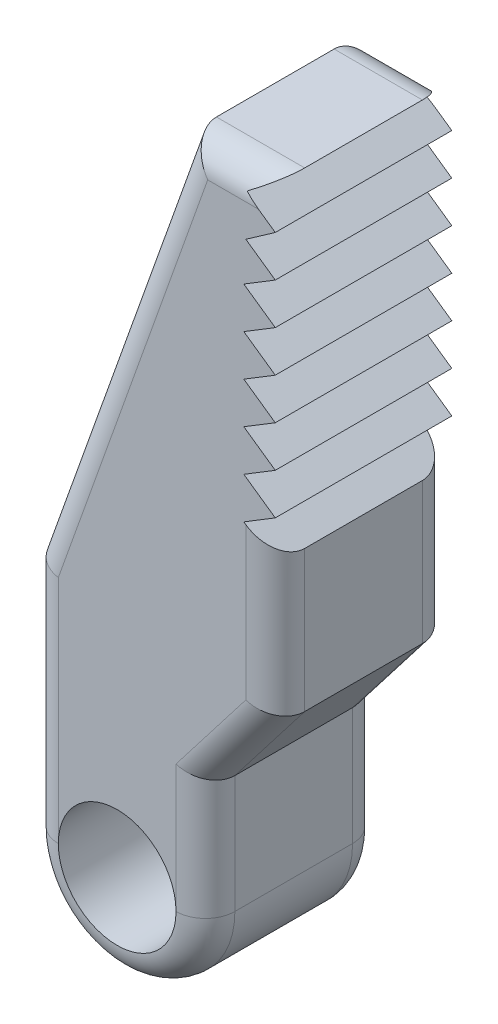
ISO-10303-21;
HEADER;
FILE_DESCRIPTION(('STEP AP214'),'2;1');
FILE_NAME('part.step','',(''),(''),'','','');
FILE_SCHEMA(('AUTOMOTIVE_DESIGN { 1 0 10303 214 1 1 1 1 }'));
ENDSEC;
DATA;
#1=APPLICATION_CONTEXT('core data for automotive mechanical design processes');
#2=APPLICATION_PROTOCOL_DEFINITION('international standard','automotive_design',2000,#1);
#3=PRODUCT_CONTEXT('',#1,'mechanical');
#4=PRODUCT('Part','Part','',(#3));
#5=PRODUCT_RELATED_PRODUCT_CATEGORY('part','',(#4));
#6=PRODUCT_DEFINITION_FORMATION('','',#4);
#7=PRODUCT_DEFINITION_CONTEXT('part definition',#1,'design');
#8=PRODUCT_DEFINITION('design','',#6,#7);
#9=PRODUCT_DEFINITION_SHAPE('','',#8);
#10=(LENGTH_UNIT() NAMED_UNIT(*) SI_UNIT(.MILLI.,.METRE.));
#11=(NAMED_UNIT(*) PLANE_ANGLE_UNIT() SI_UNIT($,.RADIAN.));
#12=(NAMED_UNIT(*) SI_UNIT($,.STERADIAN.) SOLID_ANGLE_UNIT());
#13=UNCERTAINTY_MEASURE_WITH_UNIT(LENGTH_MEASURE(1.E-05),#10,'distance_accuracy_value','');
#14=(GEOMETRIC_REPRESENTATION_CONTEXT(3) GLOBAL_UNCERTAINTY_ASSIGNED_CONTEXT((#13)) GLOBAL_UNIT_ASSIGNED_CONTEXT((#10,
#11,#12)) REPRESENTATION_CONTEXT('',''));
#15=CARTESIAN_POINT('',(0.,0.,0.));
#16=DIRECTION('',(0.,0.,1.));
#17=DIRECTION('',(1.,0.,0.));
#18=AXIS2_PLACEMENT_3D('',#15,#16,#17);
#19=CARTESIAN_POINT('',(0.,0.,30.));
#20=DIRECTION('',(0.,0.,1.));
#21=DIRECTION('',(1.,0.,0.));
#22=AXIS2_PLACEMENT_3D('',#19,#20,#21);
#23=PLANE('',#22);
#24=DIRECTION('',(0.61141501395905,0.791310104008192,0.));
#25=VECTOR('',#24,1.);
#26=CARTESIAN_POINT('',(22.9074192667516,38.4117506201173,30.));
#27=LINE('',#26,#25);
#28=CARTESIAN_POINT('',(10.,21.7066140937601,30.));
#29=VERTEX_POINT('',#28);
#30=CARTESIAN_POINT('',(21.8639697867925,37.0612896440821,30.));
#31=VERTEX_POINT('',#30);
#32=EDGE_CURVE('E411',#29,#31,#27,.T.);
#33=ORIENTED_EDGE('',*,*,#32,.T.);
#34=DIRECTION('',(0.,1.,0.));
#35=VECTOR('',#34,1.);
#36=CARTESIAN_POINT('',(21.8639697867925,59.354675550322,30.));
#37=LINE('',#36,#35);
#38=CARTESIAN_POINT('',(21.8639697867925,62.854675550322,30.));
#39=VERTEX_POINT('',#38);
#40=EDGE_CURVE('E244',#31,#39,#37,.T.);
#41=ORIENTED_EDGE('',*,*,#40,.T.);
#42=DIRECTION('',(-0.819231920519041,0.573462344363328,0.));
#43=VECTOR('',#42,1.);
#44=CARTESIAN_POINT('',(21.5211331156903,63.0946612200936,30.));
#45=LINE('',#44,#43);
#46=CARTESIAN_POINT('',(21.5211331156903,63.0946612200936,30.));
#47=VERTEX_POINT('',#46);
#48=EDGE_CURVE('E238',#39,#47,#45,.T.);
#49=ORIENTED_EDGE('',*,*,#48,.T.);
#50=DIRECTION('',(0.853640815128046,0.520862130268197,0.));
#51=VECTOR('',#50,1.);
#52=CARTESIAN_POINT('',(26.8639697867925,66.354675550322,30.));
#53=LINE('',#52,#51);
#54=CARTESIAN_POINT('',(26.8639697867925,66.354675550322,30.));
#55=VERTEX_POINT('',#54);
#56=EDGE_CURVE('E241',#47,#55,#53,.T.);
#57=ORIENTED_EDGE('',*,*,#56,.T.);
#58=DIRECTION('',(-0.819231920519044,0.573462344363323,0.));
#59=VECTOR('',#58,1.);
#60=CARTESIAN_POINT('',(21.5211331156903,70.0946612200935,30.));
#61=LINE('',#60,#59);
#62=CARTESIAN_POINT('',(21.5211331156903,70.0946612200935,30.));
#63=VERTEX_POINT('',#62);
#64=EDGE_CURVE('E262',#55,#63,#61,.T.);
#65=ORIENTED_EDGE('',*,*,#64,.T.);
#66=DIRECTION('',(0.853640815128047,0.520862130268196,0.));
#67=VECTOR('',#66,1.);
#68=CARTESIAN_POINT('',(26.8639697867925,73.354675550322,30.));
#69=LINE('',#68,#67);
#70=CARTESIAN_POINT('',(26.8639697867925,73.354675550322,30.));
#71=VERTEX_POINT('',#70);
#72=EDGE_CURVE('E264',#63,#71,#69,.T.);
#73=ORIENTED_EDGE('',*,*,#72,.T.);
#74=DIRECTION('',(-0.819231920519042,0.573462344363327,0.));
#75=VECTOR('',#74,1.);
#76=CARTESIAN_POINT('',(21.5211331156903,77.0946612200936,30.));
#77=LINE('',#76,#75);
#78=CARTESIAN_POINT('',(21.5211331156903,77.0946612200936,30.));
#79=VERTEX_POINT('',#78);
#80=EDGE_CURVE('E269',#71,#79,#77,.T.);
#81=ORIENTED_EDGE('',*,*,#80,.T.);
#82=DIRECTION('',(0.853640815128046,0.520862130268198,0.));
#83=VECTOR('',#82,1.);
#84=CARTESIAN_POINT('',(26.8639697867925,80.354675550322,30.));
#85=LINE('',#84,#83);
#86=CARTESIAN_POINT('',(26.8639697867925,80.354675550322,30.));
#87=VERTEX_POINT('',#86);
#88=EDGE_CURVE('E271',#79,#87,#85,.T.);
#89=ORIENTED_EDGE('',*,*,#88,.T.);
#90=DIRECTION('',(-0.819231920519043,0.573462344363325,0.));
#91=VECTOR('',#90,1.);
#92=CARTESIAN_POINT('',(21.5211331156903,84.0946612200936,30.));
#93=LINE('',#92,#91);
#94=CARTESIAN_POINT('',(21.5211331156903,84.0946612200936,30.));
#95=VERTEX_POINT('',#94);
#96=EDGE_CURVE('E273',#87,#95,#93,.T.);
#97=ORIENTED_EDGE('',*,*,#96,.T.);
#98=DIRECTION('',(0.853640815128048,0.520862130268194,0.));
#99=VECTOR('',#98,1.);
#100=CARTESIAN_POINT('',(26.8639697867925,87.354675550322,30.));
#101=LINE('',#100,#99);
#102=CARTESIAN_POINT('',(26.8639697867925,87.354675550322,30.));
#103=VERTEX_POINT('',#102);
#104=EDGE_CURVE('E275',#95,#103,#101,.T.);
#105=ORIENTED_EDGE('',*,*,#104,.T.);
#106=DIRECTION('',(-0.819231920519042,0.573462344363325,0.));
#107=VECTOR('',#106,1.);
#108=CARTESIAN_POINT('',(21.5211331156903,91.0946612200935,30.));
#109=LINE('',#108,#107);
#110=CARTESIAN_POINT('',(21.5211331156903,91.0946612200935,30.));
#111=VERTEX_POINT('',#110);
#112=EDGE_CURVE('E277',#103,#111,#109,.T.);
#113=ORIENTED_EDGE('',*,*,#112,.T.);
#114=DIRECTION('',(0.853640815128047,0.520862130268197,0.));
#115=VECTOR('',#114,1.);
#116=CARTESIAN_POINT('',(26.8639697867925,94.354675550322,30.));
#117=LINE('',#116,#115);
#118=CARTESIAN_POINT('',(26.8639697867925,94.354675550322,30.));
#119=VERTEX_POINT('',#118);
#120=EDGE_CURVE('E279',#111,#119,#117,.T.);
#121=ORIENTED_EDGE('',*,*,#120,.T.);
#122=DIRECTION('',(-0.819231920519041,0.573462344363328,0.));
#123=VECTOR('',#122,1.);
#124=CARTESIAN_POINT('',(21.5211331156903,98.0946612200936,30.));
#125=LINE('',#124,#123);
#126=CARTESIAN_POINT('',(21.5211331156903,98.0946612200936,30.));
#127=VERTEX_POINT('',#126);
#128=EDGE_CURVE('E281',#119,#127,#125,.T.);
#129=ORIENTED_EDGE('',*,*,#128,.T.);
#130=DIRECTION('',(0.853640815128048,0.520862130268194,0.));
#131=VECTOR('',#130,1.);
#132=CARTESIAN_POINT('',(26.8639697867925,101.354675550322,30.));
#133=LINE('',#132,#131);
#134=CARTESIAN_POINT('',(26.8639697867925,101.354675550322,30.));
#135=VERTEX_POINT('',#134);
#136=EDGE_CURVE('E283',#127,#135,#133,.T.);
#137=ORIENTED_EDGE('',*,*,#136,.T.);
#138=DIRECTION('',(-0.819231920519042,0.573462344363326,0.));
#139=VECTOR('',#138,1.);
#140=CARTESIAN_POINT('',(21.8639697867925,104.854675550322,30.));
#141=LINE('',#140,#139);
#142=CARTESIAN_POINT('',(21.8639697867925,104.854675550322,30.));
#143=VERTEX_POINT('',#142);
#144=EDGE_CURVE('E285',#135,#143,#141,.T.);
#145=ORIENTED_EDGE('',*,*,#144,.T.);
#146=DIRECTION('',(0.81923192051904,0.573462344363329,0.));
#147=VECTOR('',#146,1.);
#148=CARTESIAN_POINT('',(26.8639697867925,108.354675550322,30.));
#149=LINE('',#148,#147);
#150=CARTESIAN_POINT('',(26.8639697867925,108.354675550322,30.));
#151=VERTEX_POINT('',#150);
#152=EDGE_CURVE('E287',#143,#151,#149,.T.);
#153=ORIENTED_EDGE('',*,*,#152,.T.);
#154=DIRECTION('',(-0.81923192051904,0.573462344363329,0.));
#155=VECTOR('',#154,1.);
#156=CARTESIAN_POINT('',(21.8639697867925,111.854675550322,30.));
#157=LINE('',#156,#155);
#158=CARTESIAN_POINT('',(24.0068269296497,110.354675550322,30.));
#159=VERTEX_POINT('',#158);
#160=EDGE_CURVE('E289',#151,#159,#157,.T.);
#161=ORIENTED_EDGE('',*,*,#160,.T.);
#162=DIRECTION('',(-1.,0.,0.));
#163=VECTOR('',#162,1.);
#164=CARTESIAN_POINT('',(11.8639697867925,110.354675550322,30.));
#165=LINE('',#164,#163);
#166=CARTESIAN_POINT('',(15.3896986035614,110.354675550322,30.));
#167=VERTEX_POINT('',#166);
#168=EDGE_CURVE('E405',#159,#167,#165,.T.);
#169=ORIENTED_EDGE('',*,*,#168,.T.);
#170=DIRECTION('',(-0.335799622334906,-0.941933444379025,0.));
#171=VECTOR('',#170,1.);
#172=CARTESIAN_POINT('',(-10.2903327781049,38.3210018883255,30.));
#173=LINE('',#172,#171);
#174=CARTESIAN_POINT('',(-10.,39.1353987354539,30.));
#175=VERTEX_POINT('',#174);
#176=EDGE_CURVE('E403',#167,#175,#173,.T.);
#177=ORIENTED_EDGE('',*,*,#176,.T.);
#178=DIRECTION('',(0.,-1.,0.));
#179=VECTOR('',#178,1.);
#180=CARTESIAN_POINT('',(-10.,0.,30.));
#181=LINE('',#180,#179);
#182=CARTESIAN_POINT('',(-10.,0.,30.));
#183=VERTEX_POINT('',#182);
#184=EDGE_CURVE('E407',#175,#183,#181,.T.);
#185=ORIENTED_EDGE('',*,*,#184,.T.);
#186=CARTESIAN_POINT('',(0.,0.,30.));
#187=DIRECTION('',(0.,0.,1.));
#188=DIRECTION('',(1.,0.,0.));
#189=AXIS2_PLACEMENT_3D('',#186,#187,#188);
#190=CIRCLE('',#189,10.);
#191=CARTESIAN_POINT('',(10.,0.,30.));
#192=VERTEX_POINT('',#191);
#193=EDGE_CURVE('E295',#192,#183,#190,.T.);
#194=ORIENTED_EDGE('',*,*,#193,.F.);
#195=DIRECTION('',(0.,1.,0.));
#196=VECTOR('',#195,1.);
#197=CARTESIAN_POINT('',(10.,20.,30.));
#198=LINE('',#197,#196);
#199=EDGE_CURVE('E409',#192,#29,#198,.T.);
#200=ORIENTED_EDGE('',*,*,#199,.T.);
#201=EDGE_LOOP('',(#33,#41,#49,#57,#65,#73,#81,#89,#97,#105,#113,#121,#129,#137,#145,#153,#161,
#169,#177,#185,#194,#200));
#202=FACE_BOUND('',#201,.T.);
#203=ADVANCED_FACE('F33',(#202),#23,.T.);
#204=CARTESIAN_POINT('',(0.,0.,0.));
#205=DIRECTION('',(0.,0.,1.));
#206=DIRECTION('',(1.,0.,0.));
#207=AXIS2_PLACEMENT_3D('',#204,#205,#206);
#208=PLANE('',#207);
#209=DIRECTION('',(-0.819231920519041,0.573462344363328,0.));
#210=VECTOR('',#209,1.);
#211=CARTESIAN_POINT('',(21.5211331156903,63.0946612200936,0.));
#212=LINE('',#211,#210);
#213=CARTESIAN_POINT('',(21.8639697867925,62.854675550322,0.));
#214=VERTEX_POINT('',#213);
#215=CARTESIAN_POINT('',(21.5211331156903,63.0946612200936,0.));
#216=VERTEX_POINT('',#215);
#217=EDGE_CURVE('E253',#214,#216,#212,.T.);
#218=ORIENTED_EDGE('',*,*,#217,.F.);
#219=DIRECTION('',(0.,1.,0.));
#220=VECTOR('',#219,1.);
#221=CARTESIAN_POINT('',(21.8639697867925,0.,0.));
#222=LINE('',#221,#220);
#223=CARTESIAN_POINT('',(21.8639697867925,37.0612896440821,0.));
#224=VERTEX_POINT('',#223);
#225=EDGE_CURVE('E401',#214,#224,#222,.F.);
#226=ORIENTED_EDGE('',*,*,#225,.T.);
#227=DIRECTION('',(0.61141501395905,0.791310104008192,0.));
#228=VECTOR('',#227,1.);
#229=CARTESIAN_POINT('',(-4.24035287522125,3.27635828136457,0.));
#230=LINE('',#229,#228);
#231=CARTESIAN_POINT('',(10.,21.7066140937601,0.));
#232=VERTEX_POINT('',#231);
#233=EDGE_CURVE('E399',#224,#232,#230,.F.);
#234=ORIENTED_EDGE('',*,*,#233,.T.);
#235=DIRECTION('',(0.,1.,0.));
#236=VECTOR('',#235,1.);
#237=CARTESIAN_POINT('',(10.,0.,0.));
#238=LINE('',#237,#236);
#239=CARTESIAN_POINT('',(10.,0.,0.));
#240=VERTEX_POINT('',#239);
#241=EDGE_CURVE('E397',#232,#240,#238,.F.);
#242=ORIENTED_EDGE('',*,*,#241,.T.);
#243=CARTESIAN_POINT('',(0.,0.,0.));
#244=DIRECTION('',(0.,0.,1.));
#245=DIRECTION('',(1.,0.,0.));
#246=AXIS2_PLACEMENT_3D('',#243,#244,#245);
#247=CIRCLE('',#246,10.);
#248=CARTESIAN_POINT('',(-10.,0.,0.));
#249=VERTEX_POINT('',#248);
#250=EDGE_CURVE('E909',#240,#249,#247,.T.);
#251=ORIENTED_EDGE('',*,*,#250,.T.);
#252=DIRECTION('',(0.,-1.,0.));
#253=VECTOR('',#252,1.);
#254=CARTESIAN_POINT('',(-10.,0.,0.));
#255=LINE('',#254,#253);
#256=CARTESIAN_POINT('',(-10.,39.1353987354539,0.));
#257=VERTEX_POINT('',#256);
#258=EDGE_CURVE('E395',#249,#257,#255,.F.);
#259=ORIENTED_EDGE('',*,*,#258,.T.);
#260=DIRECTION('',(-0.335799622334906,-0.941933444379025,0.));
#261=VECTOR('',#260,1.);
#262=CARTESIAN_POINT('',(-21.2509477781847,7.57597076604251,0.));
#263=LINE('',#262,#261);
#264=CARTESIAN_POINT('',(15.3896986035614,110.354675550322,0.));
#265=VERTEX_POINT('',#264);
#266=EDGE_CURVE('E393',#257,#265,#263,.F.);
#267=ORIENTED_EDGE('',*,*,#266,.T.);
#268=DIRECTION('',(-1.,0.,0.));
#269=VECTOR('',#268,1.);
#270=CARTESIAN_POINT('',(0.,110.354675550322,0.));
#271=LINE('',#270,#269);
#272=CARTESIAN_POINT('',(24.0068269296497,110.354675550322,0.));
#273=VERTEX_POINT('',#272);
#274=EDGE_CURVE('E391',#265,#273,#271,.F.);
#275=ORIENTED_EDGE('',*,*,#274,.T.);
#276=DIRECTION('',(-0.81923192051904,0.573462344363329,0.));
#277=VECTOR('',#276,1.);
#278=CARTESIAN_POINT('',(21.8639697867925,111.854675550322,0.));
#279=LINE('',#278,#277);
#280=CARTESIAN_POINT('',(26.8639697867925,108.354675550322,0.));
#281=VERTEX_POINT('',#280);
#282=EDGE_CURVE('E246',#281,#273,#279,.T.);
#283=ORIENTED_EDGE('',*,*,#282,.F.);
#284=DIRECTION('',(0.81923192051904,0.573462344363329,0.));
#285=VECTOR('',#284,1.);
#286=CARTESIAN_POINT('',(26.8639697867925,108.354675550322,0.));
#287=LINE('',#286,#285);
#288=CARTESIAN_POINT('',(21.8639697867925,104.854675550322,0.));
#289=VERTEX_POINT('',#288);
#290=EDGE_CURVE('E319',#289,#281,#287,.T.);
#291=ORIENTED_EDGE('',*,*,#290,.F.);
#292=DIRECTION('',(-0.819231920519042,0.573462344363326,0.));
#293=VECTOR('',#292,1.);
#294=CARTESIAN_POINT('',(21.8639697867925,104.854675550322,0.));
#295=LINE('',#294,#293);
#296=CARTESIAN_POINT('',(26.8639697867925,101.354675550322,0.));
#297=VERTEX_POINT('',#296);
#298=EDGE_CURVE('E317',#297,#289,#295,.T.);
#299=ORIENTED_EDGE('',*,*,#298,.F.);
#300=DIRECTION('',(0.853640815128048,0.520862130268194,0.));
#301=VECTOR('',#300,1.);
#302=CARTESIAN_POINT('',(26.8639697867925,101.354675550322,0.));
#303=LINE('',#302,#301);
#304=CARTESIAN_POINT('',(21.5211331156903,98.0946612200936,0.));
#305=VERTEX_POINT('',#304);
#306=EDGE_CURVE('E315',#305,#297,#303,.T.);
#307=ORIENTED_EDGE('',*,*,#306,.F.);
#308=DIRECTION('',(-0.819231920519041,0.573462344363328,0.));
#309=VECTOR('',#308,1.);
#310=CARTESIAN_POINT('',(21.5211331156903,98.0946612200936,0.));
#311=LINE('',#310,#309);
#312=CARTESIAN_POINT('',(26.8639697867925,94.354675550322,0.));
#313=VERTEX_POINT('',#312);
#314=EDGE_CURVE('E313',#313,#305,#311,.T.);
#315=ORIENTED_EDGE('',*,*,#314,.F.);
#316=DIRECTION('',(0.853640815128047,0.520862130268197,0.));
#317=VECTOR('',#316,1.);
#318=CARTESIAN_POINT('',(26.8639697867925,94.354675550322,0.));
#319=LINE('',#318,#317);
#320=CARTESIAN_POINT('',(21.5211331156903,91.0946612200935,0.));
#321=VERTEX_POINT('',#320);
#322=EDGE_CURVE('E311',#321,#313,#319,.T.);
#323=ORIENTED_EDGE('',*,*,#322,.F.);
#324=DIRECTION('',(-0.819231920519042,0.573462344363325,0.));
#325=VECTOR('',#324,1.);
#326=CARTESIAN_POINT('',(21.5211331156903,91.0946612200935,0.));
#327=LINE('',#326,#325);
#328=CARTESIAN_POINT('',(26.8639697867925,87.354675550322,0.));
#329=VERTEX_POINT('',#328);
#330=EDGE_CURVE('E309',#329,#321,#327,.T.);
#331=ORIENTED_EDGE('',*,*,#330,.F.);
#332=DIRECTION('',(0.853640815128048,0.520862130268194,0.));
#333=VECTOR('',#332,1.);
#334=CARTESIAN_POINT('',(26.8639697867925,87.354675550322,0.));
#335=LINE('',#334,#333);
#336=CARTESIAN_POINT('',(21.5211331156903,84.0946612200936,0.));
#337=VERTEX_POINT('',#336);
#338=EDGE_CURVE('E307',#337,#329,#335,.T.);
#339=ORIENTED_EDGE('',*,*,#338,.F.);
#340=DIRECTION('',(-0.819231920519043,0.573462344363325,0.));
#341=VECTOR('',#340,1.);
#342=CARTESIAN_POINT('',(21.5211331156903,84.0946612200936,0.));
#343=LINE('',#342,#341);
#344=CARTESIAN_POINT('',(26.8639697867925,80.354675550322,0.));
#345=VERTEX_POINT('',#344);
#346=EDGE_CURVE('E305',#345,#337,#343,.T.);
#347=ORIENTED_EDGE('',*,*,#346,.F.);
#348=DIRECTION('',(0.853640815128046,0.520862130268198,0.));
#349=VECTOR('',#348,1.);
#350=CARTESIAN_POINT('',(26.8639697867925,80.354675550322,0.));
#351=LINE('',#350,#349);
#352=CARTESIAN_POINT('',(21.5211331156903,77.0946612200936,0.));
#353=VERTEX_POINT('',#352);
#354=EDGE_CURVE('E303',#353,#345,#351,.T.);
#355=ORIENTED_EDGE('',*,*,#354,.F.);
#356=DIRECTION('',(-0.819231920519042,0.573462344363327,0.));
#357=VECTOR('',#356,1.);
#358=CARTESIAN_POINT('',(21.5211331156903,77.0946612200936,0.));
#359=LINE('',#358,#357);
#360=CARTESIAN_POINT('',(26.8639697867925,73.354675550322,0.));
#361=VERTEX_POINT('',#360);
#362=EDGE_CURVE('E301',#361,#353,#359,.T.);
#363=ORIENTED_EDGE('',*,*,#362,.F.);
#364=DIRECTION('',(0.853640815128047,0.520862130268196,0.));
#365=VECTOR('',#364,1.);
#366=CARTESIAN_POINT('',(26.8639697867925,73.354675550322,0.));
#367=LINE('',#366,#365);
#368=CARTESIAN_POINT('',(21.5211331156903,70.0946612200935,0.));
#369=VERTEX_POINT('',#368);
#370=EDGE_CURVE('E299',#369,#361,#367,.T.);
#371=ORIENTED_EDGE('',*,*,#370,.F.);
#372=DIRECTION('',(-0.819231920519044,0.573462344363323,0.));
#373=VECTOR('',#372,1.);
#374=CARTESIAN_POINT('',(21.5211331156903,70.0946612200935,0.));
#375=LINE('',#374,#373);
#376=CARTESIAN_POINT('',(26.8639697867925,66.354675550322,0.));
#377=VERTEX_POINT('',#376);
#378=EDGE_CURVE('E297',#377,#369,#375,.T.);
#379=ORIENTED_EDGE('',*,*,#378,.F.);
#380=DIRECTION('',(0.853640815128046,0.520862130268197,0.));
#381=VECTOR('',#380,1.);
#382=CARTESIAN_POINT('',(26.8639697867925,66.354675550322,0.));
#383=LINE('',#382,#381);
#384=EDGE_CURVE('E294',#216,#377,#383,.T.);
#385=ORIENTED_EDGE('',*,*,#384,.F.);
#386=EDGE_LOOP('',(#218,#226,#234,#242,#251,#259,#267,#275,#283,#291,#299,#307,#315,#323,#331,
#339,#347,#355,#363,#371,#379,#385));
#387=FACE_BOUND('',#386,.T.);
#388=ADVANCED_FACE('F556',(#387),#208,.F.);
#389=CARTESIAN_POINT('',(0.,0.,30.));
#390=DIRECTION('',(0.,0.,-1.));
#391=DIRECTION('',(-1.,0.,0.));
#392=AXIS2_PLACEMENT_3D('',#389,#390,#391);
#393=CYLINDRICAL_SURFACE('',#392,15.);
#394=DIRECTION('',(0.,0.,-1.));
#395=VECTOR('',#394,1.);
#396=CARTESIAN_POINT('',(-15.,0.,30.));
#397=LINE('',#396,#395);
#398=CARTESIAN_POINT('',(-15.,0.,25.));
#399=VERTEX_POINT('',#398);
#400=CARTESIAN_POINT('',(-15.,0.,5.));
#401=VERTEX_POINT('',#400);
#402=EDGE_CURVE('E292',#399,#401,#397,.T.);
#403=ORIENTED_EDGE('',*,*,#402,.T.);
#404=CARTESIAN_POINT('',(0.,0.,5.));
#405=DIRECTION('',(0.,0.,1.));
#406=DIRECTION('',(1.,0.,0.));
#407=AXIS2_PLACEMENT_3D('',#404,#405,#406);
#408=CIRCLE('',#407,15.);
#409=CARTESIAN_POINT('',(15.,0.,5.));
#410=VERTEX_POINT('',#409);
#411=EDGE_CURVE('E424',#401,#410,#408,.T.);
#412=ORIENTED_EDGE('',*,*,#411,.T.);
#413=DIRECTION('',(0.,0.,-1.));
#414=VECTOR('',#413,1.);
#415=CARTESIAN_POINT('',(15.,0.,30.));
#416=LINE('',#415,#414);
#417=CARTESIAN_POINT('',(15.,0.,25.));
#418=VERTEX_POINT('',#417);
#419=EDGE_CURVE('E379',#418,#410,#416,.T.);
#420=ORIENTED_EDGE('',*,*,#419,.F.);
#421=CARTESIAN_POINT('',(0.,0.,25.));
#422=DIRECTION('',(0.,0.,1.));
#423=DIRECTION('',(1.,0.,0.));
#424=AXIS2_PLACEMENT_3D('',#421,#422,#423);
#425=CIRCLE('',#424,15.);
#426=EDGE_CURVE('E422',#418,#399,#425,.F.);
#427=ORIENTED_EDGE('',*,*,#426,.T.);
#428=EDGE_LOOP('',(#403,#412,#420,#427));
#429=FACE_BOUND('',#428,.T.);
#430=ADVANCED_FACE('F522',(#429),#393,.T.);
#431=CARTESIAN_POINT('',(15.,0.,30.));
#432=DIRECTION('',(-1.,0.,0.));
#433=DIRECTION('',(0.,0.,1.));
#434=AXIS2_PLACEMENT_3D('',#431,#432,#433);
#435=PLANE('',#434);
#436=ORIENTED_EDGE('',*,*,#419,.T.);
#437=DIRECTION('',(0.,1.,0.));
#438=VECTOR('',#437,1.);
#439=CARTESIAN_POINT('',(15.,0.,5.));
#440=LINE('',#439,#438);
#441=CARTESIAN_POINT('',(15.,20.,5.));
#442=VERTEX_POINT('',#441);
#443=EDGE_CURVE('E420',#410,#442,#440,.T.);
#444=ORIENTED_EDGE('',*,*,#443,.T.);
#445=DIRECTION('',(0.,0.,-1.));
#446=VECTOR('',#445,1.);
#447=CARTESIAN_POINT('',(15.,20.,30.));
#448=LINE('',#447,#446);
#449=CARTESIAN_POINT('',(15.,20.,25.));
#450=VERTEX_POINT('',#449);
#451=EDGE_CURVE('E376',#450,#442,#448,.T.);
#452=ORIENTED_EDGE('',*,*,#451,.F.);
#453=DIRECTION('',(0.,1.,0.));
#454=VECTOR('',#453,1.);
#455=CARTESIAN_POINT('',(15.,0.,25.));
#456=LINE('',#455,#454);
#457=EDGE_CURVE('E418',#450,#418,#456,.F.);
#458=ORIENTED_EDGE('',*,*,#457,.T.);
#459=EDGE_LOOP('',(#436,#444,#452,#458));
#460=FACE_BOUND('',#459,.T.);
#461=ADVANCED_FACE('F525',(#460),#435,.F.);
#462=CARTESIAN_POINT('',(26.8639697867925,35.354675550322,30.));
#463=DIRECTION('',(-0.791310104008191,0.61141501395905,0.));
#464=DIRECTION('',(-0.61141501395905,-0.791310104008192,0.));
#465=AXIS2_PLACEMENT_3D('',#462,#463,#464);
#466=PLANE('',#465);
#467=ORIENTED_EDGE('',*,*,#451,.T.);
#468=DIRECTION('',(0.61141501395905,0.791310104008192,0.));
#469=VECTOR('',#468,1.);
#470=CARTESIAN_POINT('',(26.8639697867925,35.354675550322,5.));
#471=LINE('',#470,#469);
#472=CARTESIAN_POINT('',(26.8639697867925,35.354675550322,5.));
#473=VERTEX_POINT('',#472);
#474=EDGE_CURVE('E416',#442,#473,#471,.T.);
#475=ORIENTED_EDGE('',*,*,#474,.T.);
#476=DIRECTION('',(0.,0.,-1.));
#477=VECTOR('',#476,1.);
#478=CARTESIAN_POINT('',(26.8639697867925,35.354675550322,30.));
#479=LINE('',#478,#477);
#480=CARTESIAN_POINT('',(26.8639697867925,35.354675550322,25.));
#481=VERTEX_POINT('',#480);
#482=EDGE_CURVE('E373',#481,#473,#479,.T.);
#483=ORIENTED_EDGE('',*,*,#482,.F.);
#484=DIRECTION('',(0.61141501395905,0.791310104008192,0.));
#485=VECTOR('',#484,1.);
#486=CARTESIAN_POINT('',(15.,20.,25.));
#487=LINE('',#486,#485);
#488=EDGE_CURVE('E414',#481,#450,#487,.F.);
#489=ORIENTED_EDGE('',*,*,#488,.T.);
#490=EDGE_LOOP('',(#467,#475,#483,#489));
#491=FACE_BOUND('',#490,.T.);
#492=ADVANCED_FACE('F632',(#491),#466,.F.);
#493=CARTESIAN_POINT('',(26.8639697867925,59.354675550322,30.));
#494=DIRECTION('',(-1.,0.,0.));
#495=DIRECTION('',(0.,-1.,0.));
#496=AXIS2_PLACEMENT_3D('',#493,#494,#495);
#497=PLANE('',#496);
#498=ORIENTED_EDGE('',*,*,#482,.T.);
#499=DIRECTION('',(0.,1.,0.));
#500=VECTOR('',#499,1.);
#501=CARTESIAN_POINT('',(26.8639697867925,59.354675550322,5.));
#502=LINE('',#501,#500);
#503=CARTESIAN_POINT('',(26.8639697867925,59.354675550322,5.));
#504=VERTEX_POINT('',#503);
#505=EDGE_CURVE('E384',#473,#504,#502,.T.);
#506=ORIENTED_EDGE('',*,*,#505,.T.);
#507=DIRECTION('',(0.,0.,-1.));
#508=VECTOR('',#507,1.);
#509=CARTESIAN_POINT('',(26.8639697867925,59.354675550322,30.));
#510=LINE('',#509,#508);
#511=CARTESIAN_POINT('',(26.8639697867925,59.354675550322,25.));
#512=VERTEX_POINT('',#511);
#513=EDGE_CURVE('E256',#512,#504,#510,.T.);
#514=ORIENTED_EDGE('',*,*,#513,.F.);
#515=DIRECTION('',(0.,1.,0.));
#516=VECTOR('',#515,1.);
#517=CARTESIAN_POINT('',(26.8639697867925,35.354675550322,25.));
#518=LINE('',#517,#516);
#519=EDGE_CURVE('E382',#512,#481,#518,.F.);
#520=ORIENTED_EDGE('',*,*,#519,.T.);
#521=EDGE_LOOP('',(#498,#506,#514,#520));
#522=FACE_BOUND('',#521,.T.);
#523=ADVANCED_FACE('F629',(#522),#497,.F.);
#524=CARTESIAN_POINT('',(21.5211331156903,63.0946612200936,30.));
#525=DIRECTION('',(-0.573462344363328,-0.819231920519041,0.));
#526=DIRECTION('',(0.819231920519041,-0.573462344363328,0.));
#527=AXIS2_PLACEMENT_3D('',#524,#525,#526);
#528=PLANE('',#527);
#529=ORIENTED_EDGE('',*,*,#513,.T.);
#530=CARTESIAN_POINT('',(21.8639697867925,62.854675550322,5.));
#531=DIRECTION('',(-0.573462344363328,-0.819231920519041,0.));
#532=DIRECTION('',(-0.819231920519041,0.573462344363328,0.));
#533=AXIS2_PLACEMENT_3D('',#530,#531,#532);
#534=ELLIPSE('',#533,6.10327780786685,5.);
#535=EDGE_CURVE('E389',#504,#214,#534,.F.);
#536=ORIENTED_EDGE('',*,*,#535,.T.);
#537=ORIENTED_EDGE('',*,*,#217,.T.);
#538=DIRECTION('',(0.,0.,-1.));
#539=VECTOR('',#538,1.);
#540=CARTESIAN_POINT('',(21.5211331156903,63.0946612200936,30.));
#541=LINE('',#540,#539);
#542=EDGE_CURVE('E249',#47,#216,#541,.T.);
#543=ORIENTED_EDGE('',*,*,#542,.F.);
#544=ORIENTED_EDGE('',*,*,#48,.F.);
#545=CARTESIAN_POINT('',(21.8639697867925,62.854675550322,25.));
#546=DIRECTION('',(-0.573462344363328,-0.819231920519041,0.));
#547=DIRECTION('',(0.819231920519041,-0.573462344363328,0.));
#548=AXIS2_PLACEMENT_3D('',#545,#546,#547);
#549=ELLIPSE('',#548,6.10327780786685,5.);
#550=EDGE_CURVE('E387',#39,#512,#549,.F.);
#551=ORIENTED_EDGE('',*,*,#550,.T.);
#552=EDGE_LOOP('',(#529,#536,#537,#543,#544,#551));
#553=FACE_BOUND('',#552,.T.);
#554=ADVANCED_FACE('F251',(#553),#528,.F.);
#555=CARTESIAN_POINT('',(26.8639697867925,66.354675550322,30.));
#556=DIRECTION('',(-0.520862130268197,0.853640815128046,0.));
#557=DIRECTION('',(-0.853640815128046,-0.520862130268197,0.));
#558=AXIS2_PLACEMENT_3D('',#555,#556,#557);
#559=PLANE('',#558);
#560=ORIENTED_EDGE('',*,*,#384,.T.);
#561=DIRECTION('',(0.,0.,-1.));
#562=VECTOR('',#561,1.);
#563=CARTESIAN_POINT('',(26.8639697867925,66.354675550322,30.));
#564=LINE('',#563,#562);
#565=EDGE_CURVE('E257',#55,#377,#564,.T.);
#566=ORIENTED_EDGE('',*,*,#565,.F.);
#567=ORIENTED_EDGE('',*,*,#56,.F.);
#568=ORIENTED_EDGE('',*,*,#542,.T.);
#569=EDGE_LOOP('',(#560,#566,#567,#568));
#570=FACE_BOUND('',#569,.T.);
#571=ADVANCED_FACE('F259',(#570),#559,.F.);
#572=CARTESIAN_POINT('',(21.5211331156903,70.0946612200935,30.));
#573=DIRECTION('',(-0.573462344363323,-0.819231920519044,0.));
#574=DIRECTION('',(0.819231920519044,-0.573462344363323,0.));
#575=AXIS2_PLACEMENT_3D('',#572,#573,#574);
#576=PLANE('',#575);
#577=ORIENTED_EDGE('',*,*,#378,.T.);
#578=DIRECTION('',(0.,0.,-1.));
#579=VECTOR('',#578,1.);
#580=CARTESIAN_POINT('',(21.5211331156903,70.0946612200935,30.));
#581=LINE('',#580,#579);
#582=EDGE_CURVE('E368',#63,#369,#581,.T.);
#583=ORIENTED_EDGE('',*,*,#582,.F.);
#584=ORIENTED_EDGE('',*,*,#64,.F.);
#585=ORIENTED_EDGE('',*,*,#565,.T.);
#586=EDGE_LOOP('',(#577,#583,#584,#585));
#587=FACE_BOUND('',#586,.T.);
#588=ADVANCED_FACE('F620',(#587),#576,.F.);
#589=CARTESIAN_POINT('',(26.8639697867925,73.354675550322,30.));
#590=DIRECTION('',(-0.520862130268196,0.853640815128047,0.));
#591=DIRECTION('',(-0.853640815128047,-0.520862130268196,0.));
#592=AXIS2_PLACEMENT_3D('',#589,#590,#591);
#593=PLANE('',#592);
#594=ORIENTED_EDGE('',*,*,#370,.T.);
#595=DIRECTION('',(0.,0.,-1.));
#596=VECTOR('',#595,1.);
#597=CARTESIAN_POINT('',(26.8639697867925,73.354675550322,30.));
#598=LINE('',#597,#596);
#599=EDGE_CURVE('E365',#71,#361,#598,.T.);
#600=ORIENTED_EDGE('',*,*,#599,.F.);
#601=ORIENTED_EDGE('',*,*,#72,.F.);
#602=ORIENTED_EDGE('',*,*,#582,.T.);
#603=EDGE_LOOP('',(#594,#600,#601,#602));
#604=FACE_BOUND('',#603,.T.);
#605=ADVANCED_FACE('F616',(#604),#593,.F.);
#606=CARTESIAN_POINT('',(21.5211331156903,77.0946612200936,30.));
#607=DIRECTION('',(-0.573462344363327,-0.819231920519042,0.));
#608=DIRECTION('',(0.819231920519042,-0.573462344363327,0.));
#609=AXIS2_PLACEMENT_3D('',#606,#607,#608);
#610=PLANE('',#609);
#611=ORIENTED_EDGE('',*,*,#362,.T.);
#612=DIRECTION('',(0.,0.,-1.));
#613=VECTOR('',#612,1.);
#614=CARTESIAN_POINT('',(21.5211331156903,77.0946612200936,30.));
#615=LINE('',#614,#613);
#616=EDGE_CURVE('E362',#79,#353,#615,.T.);
#617=ORIENTED_EDGE('',*,*,#616,.F.);
#618=ORIENTED_EDGE('',*,*,#80,.F.);
#619=ORIENTED_EDGE('',*,*,#599,.T.);
#620=EDGE_LOOP('',(#611,#617,#618,#619));
#621=FACE_BOUND('',#620,.T.);
#622=ADVANCED_FACE('F612',(#621),#610,.F.);
#623=CARTESIAN_POINT('',(26.8639697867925,80.354675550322,30.));
#624=DIRECTION('',(-0.520862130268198,0.853640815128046,0.));
#625=DIRECTION('',(-0.853640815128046,-0.520862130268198,0.));
#626=AXIS2_PLACEMENT_3D('',#623,#624,#625);
#627=PLANE('',#626);
#628=ORIENTED_EDGE('',*,*,#354,.T.);
#629=DIRECTION('',(0.,0.,-1.));
#630=VECTOR('',#629,1.);
#631=CARTESIAN_POINT('',(26.8639697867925,80.354675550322,30.));
#632=LINE('',#631,#630);
#633=EDGE_CURVE('E359',#87,#345,#632,.T.);
#634=ORIENTED_EDGE('',*,*,#633,.F.);
#635=ORIENTED_EDGE('',*,*,#88,.F.);
#636=ORIENTED_EDGE('',*,*,#616,.T.);
#637=EDGE_LOOP('',(#628,#634,#635,#636));
#638=FACE_BOUND('',#637,.T.);
#639=ADVANCED_FACE('F608',(#638),#627,.F.);
#640=CARTESIAN_POINT('',(21.5211331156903,84.0946612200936,30.));
#641=DIRECTION('',(-0.573462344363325,-0.819231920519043,0.));
#642=DIRECTION('',(0.819231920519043,-0.573462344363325,0.));
#643=AXIS2_PLACEMENT_3D('',#640,#641,#642);
#644=PLANE('',#643);
#645=ORIENTED_EDGE('',*,*,#346,.T.);
#646=DIRECTION('',(0.,0.,-1.));
#647=VECTOR('',#646,1.);
#648=CARTESIAN_POINT('',(21.5211331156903,84.0946612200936,30.));
#649=LINE('',#648,#647);
#650=EDGE_CURVE('E356',#95,#337,#649,.T.);
#651=ORIENTED_EDGE('',*,*,#650,.F.);
#652=ORIENTED_EDGE('',*,*,#96,.F.);
#653=ORIENTED_EDGE('',*,*,#633,.T.);
#654=EDGE_LOOP('',(#645,#651,#652,#653));
#655=FACE_BOUND('',#654,.T.);
#656=ADVANCED_FACE('F604',(#655),#644,.F.);
#657=CARTESIAN_POINT('',(26.8639697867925,87.354675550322,30.));
#658=DIRECTION('',(-0.520862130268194,0.853640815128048,0.));
#659=DIRECTION('',(-0.853640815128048,-0.520862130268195,0.));
#660=AXIS2_PLACEMENT_3D('',#657,#658,#659);
#661=PLANE('',#660);
#662=ORIENTED_EDGE('',*,*,#338,.T.);
#663=DIRECTION('',(0.,0.,-1.));
#664=VECTOR('',#663,1.);
#665=CARTESIAN_POINT('',(26.8639697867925,87.354675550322,30.));
#666=LINE('',#665,#664);
#667=EDGE_CURVE('E353',#103,#329,#666,.T.);
#668=ORIENTED_EDGE('',*,*,#667,.F.);
#669=ORIENTED_EDGE('',*,*,#104,.F.);
#670=ORIENTED_EDGE('',*,*,#650,.T.);
#671=EDGE_LOOP('',(#662,#668,#669,#670));
#672=FACE_BOUND('',#671,.T.);
#673=ADVANCED_FACE('F600',(#672),#661,.F.);
#674=CARTESIAN_POINT('',(21.5211331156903,91.0946612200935,30.));
#675=DIRECTION('',(-0.573462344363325,-0.819231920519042,0.));
#676=DIRECTION('',(0.819231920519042,-0.573462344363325,0.));
#677=AXIS2_PLACEMENT_3D('',#674,#675,#676);
#678=PLANE('',#677);
#679=ORIENTED_EDGE('',*,*,#330,.T.);
#680=DIRECTION('',(0.,0.,-1.));
#681=VECTOR('',#680,1.);
#682=CARTESIAN_POINT('',(21.5211331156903,91.0946612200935,30.));
#683=LINE('',#682,#681);
#684=EDGE_CURVE('E350',#111,#321,#683,.T.);
#685=ORIENTED_EDGE('',*,*,#684,.F.);
#686=ORIENTED_EDGE('',*,*,#112,.F.);
#687=ORIENTED_EDGE('',*,*,#667,.T.);
#688=EDGE_LOOP('',(#679,#685,#686,#687));
#689=FACE_BOUND('',#688,.T.);
#690=ADVANCED_FACE('F596',(#689),#678,.F.);
#691=CARTESIAN_POINT('',(26.8639697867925,94.354675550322,30.));
#692=DIRECTION('',(-0.520862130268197,0.853640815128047,0.));
#693=DIRECTION('',(-0.853640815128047,-0.520862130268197,0.));
#694=AXIS2_PLACEMENT_3D('',#691,#692,#693);
#695=PLANE('',#694);
#696=ORIENTED_EDGE('',*,*,#322,.T.);
#697=DIRECTION('',(0.,0.,-1.));
#698=VECTOR('',#697,1.);
#699=CARTESIAN_POINT('',(26.8639697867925,94.354675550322,30.));
#700=LINE('',#699,#698);
#701=EDGE_CURVE('E347',#119,#313,#700,.T.);
#702=ORIENTED_EDGE('',*,*,#701,.F.);
#703=ORIENTED_EDGE('',*,*,#120,.F.);
#704=ORIENTED_EDGE('',*,*,#684,.T.);
#705=EDGE_LOOP('',(#696,#702,#703,#704));
#706=FACE_BOUND('',#705,.T.);
#707=ADVANCED_FACE('F592',(#706),#695,.F.);
#708=CARTESIAN_POINT('',(21.5211331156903,98.0946612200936,30.));
#709=DIRECTION('',(-0.573462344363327,-0.819231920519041,0.));
#710=DIRECTION('',(0.819231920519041,-0.573462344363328,0.));
#711=AXIS2_PLACEMENT_3D('',#708,#709,#710);
#712=PLANE('',#711);
#713=ORIENTED_EDGE('',*,*,#314,.T.);
#714=DIRECTION('',(0.,0.,-1.));
#715=VECTOR('',#714,1.);
#716=CARTESIAN_POINT('',(21.5211331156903,98.0946612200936,30.));
#717=LINE('',#716,#715);
#718=EDGE_CURVE('E344',#127,#305,#717,.T.);
#719=ORIENTED_EDGE('',*,*,#718,.F.);
#720=ORIENTED_EDGE('',*,*,#128,.F.);
#721=ORIENTED_EDGE('',*,*,#701,.T.);
#722=EDGE_LOOP('',(#713,#719,#720,#721));
#723=FACE_BOUND('',#722,.T.);
#724=ADVANCED_FACE('F588',(#723),#712,.F.);
#725=CARTESIAN_POINT('',(26.8639697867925,101.354675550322,30.));
#726=DIRECTION('',(-0.520862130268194,0.853640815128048,0.));
#727=DIRECTION('',(-0.853640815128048,-0.520862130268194,0.));
#728=AXIS2_PLACEMENT_3D('',#725,#726,#727);
#729=PLANE('',#728);
#730=ORIENTED_EDGE('',*,*,#306,.T.);
#731=DIRECTION('',(0.,0.,-1.));
#732=VECTOR('',#731,1.);
#733=CARTESIAN_POINT('',(26.8639697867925,101.354675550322,30.));
#734=LINE('',#733,#732);
#735=EDGE_CURVE('E341',#135,#297,#734,.T.);
#736=ORIENTED_EDGE('',*,*,#735,.F.);
#737=ORIENTED_EDGE('',*,*,#136,.F.);
#738=ORIENTED_EDGE('',*,*,#718,.T.);
#739=EDGE_LOOP('',(#730,#736,#737,#738));
#740=FACE_BOUND('',#739,.T.);
#741=ADVANCED_FACE('F584',(#740),#729,.F.);
#742=CARTESIAN_POINT('',(21.8639697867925,104.854675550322,30.));
#743=DIRECTION('',(-0.573462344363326,-0.819231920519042,0.));
#744=DIRECTION('',(0.819231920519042,-0.573462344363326,0.));
#745=AXIS2_PLACEMENT_3D('',#742,#743,#744);
#746=PLANE('',#745);
#747=ORIENTED_EDGE('',*,*,#298,.T.);
#748=DIRECTION('',(0.,0.,-1.));
#749=VECTOR('',#748,1.);
#750=CARTESIAN_POINT('',(21.8639697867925,104.854675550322,30.));
#751=LINE('',#750,#749);
#752=EDGE_CURVE('E338',#143,#289,#751,.T.);
#753=ORIENTED_EDGE('',*,*,#752,.F.);
#754=ORIENTED_EDGE('',*,*,#144,.F.);
#755=ORIENTED_EDGE('',*,*,#735,.T.);
#756=EDGE_LOOP('',(#747,#753,#754,#755));
#757=FACE_BOUND('',#756,.T.);
#758=ADVANCED_FACE('F580',(#757),#746,.F.);
#759=CARTESIAN_POINT('',(26.8639697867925,108.354675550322,30.));
#760=DIRECTION('',(-0.573462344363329,0.81923192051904,0.));
#761=DIRECTION('',(-0.81923192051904,-0.573462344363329,0.));
#762=AXIS2_PLACEMENT_3D('',#759,#760,#761);
#763=PLANE('',#762);
#764=ORIENTED_EDGE('',*,*,#290,.T.);
#765=DIRECTION('',(0.,0.,-1.));
#766=VECTOR('',#765,1.);
#767=CARTESIAN_POINT('',(26.8639697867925,108.354675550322,30.));
#768=LINE('',#767,#766);
#769=EDGE_CURVE('E335',#151,#281,#768,.T.);
#770=ORIENTED_EDGE('',*,*,#769,.F.);
#771=ORIENTED_EDGE('',*,*,#152,.F.);
#772=ORIENTED_EDGE('',*,*,#752,.T.);
#773=EDGE_LOOP('',(#764,#770,#771,#772));
#774=FACE_BOUND('',#773,.T.);
#775=ADVANCED_FACE('F577',(#774),#763,.F.);
#776=CARTESIAN_POINT('',(21.8639697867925,111.854675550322,30.));
#777=DIRECTION('',(-0.573462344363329,-0.81923192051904,0.));
#778=DIRECTION('',(0.81923192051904,-0.573462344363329,0.));
#779=AXIS2_PLACEMENT_3D('',#776,#777,#778);
#780=PLANE('',#779);
#781=ORIENTED_EDGE('',*,*,#282,.T.);
#782=CARTESIAN_POINT('',(24.0068269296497,110.354675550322,5.));
#783=DIRECTION('',(-0.573462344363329,-0.81923192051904,0.));
#784=DIRECTION('',(-0.81923192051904,0.573462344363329,0.));
#785=AXIS2_PLACEMENT_3D('',#782,#783,#784);
#786=ELLIPSE('',#785,8.71896829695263,5.);
#787=CARTESIAN_POINT('',(21.8639697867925,111.854675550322,0.230303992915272));
#788=VERTEX_POINT('',#787);
#789=EDGE_CURVE('E50',#273,#788,#786,.F.);
#790=ORIENTED_EDGE('',*,*,#789,.T.);
#791=DIRECTION('',(0.,0.,-1.));
#792=VECTOR('',#791,1.);
#793=CARTESIAN_POINT('',(21.8639697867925,111.854675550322,30.));
#794=LINE('',#793,#792);
#795=CARTESIAN_POINT('',(21.8639697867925,111.854675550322,29.7696960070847));
#796=VERTEX_POINT('',#795);
#797=EDGE_CURVE('E333',#796,#788,#794,.T.);
#798=ORIENTED_EDGE('',*,*,#797,.F.);
#799=CARTESIAN_POINT('',(24.0068269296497,110.354675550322,25.));
#800=DIRECTION('',(-0.573462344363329,-0.81923192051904,0.));
#801=DIRECTION('',(0.81923192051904,-0.573462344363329,0.));
#802=AXIS2_PLACEMENT_3D('',#799,#800,#801);
#803=ELLIPSE('',#802,8.71896829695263,5.);
#804=EDGE_CURVE('E438',#796,#159,#803,.F.);
#805=ORIENTED_EDGE('',*,*,#804,.T.);
#806=ORIENTED_EDGE('',*,*,#160,.F.);
#807=ORIENTED_EDGE('',*,*,#769,.T.);
#808=EDGE_LOOP('',(#781,#790,#798,#805,#806,#807));
#809=FACE_BOUND('',#808,.T.);
#810=ADVANCED_FACE('F574',(#809),#780,.F.);
#811=CARTESIAN_POINT('',(26.8639697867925,115.354675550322,30.));
#812=DIRECTION('',(-0.573462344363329,0.81923192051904,0.));
#813=DIRECTION('',(-0.81923192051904,-0.573462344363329,0.));
#814=AXIS2_PLACEMENT_3D('',#811,#812,#813);
#815=PLANE('',#814);
#816=ORIENTED_EDGE('',*,*,#797,.T.);
#817=CARTESIAN_POINT('',(19.7211126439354,110.354675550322,5.));
#818=DIRECTION('',(-0.573462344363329,0.81923192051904,0.));
#819=DIRECTION('',(-0.81923192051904,-0.573462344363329,0.));
#820=AXIS2_PLACEMENT_3D('',#817,#818,#819);
#821=ELLIPSE('',#820,8.71896829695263,5.);
#822=CARTESIAN_POINT('',(26.8639697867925,115.354675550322,5.));
#823=VERTEX_POINT('',#822);
#824=EDGE_CURVE('E11',#788,#823,#821,.F.);
#825=ORIENTED_EDGE('',*,*,#824,.T.);
#826=DIRECTION('',(0.,0.,-1.));
#827=VECTOR('',#826,1.);
#828=CARTESIAN_POINT('',(26.8639697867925,115.354675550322,30.));
#829=LINE('',#828,#827);
#830=CARTESIAN_POINT('',(26.8639697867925,115.354675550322,25.));
#831=VERTEX_POINT('',#830);
#832=EDGE_CURVE('E330',#831,#823,#829,.T.);
#833=ORIENTED_EDGE('',*,*,#832,.F.);
#834=CARTESIAN_POINT('',(19.7211126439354,110.354675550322,25.));
#835=DIRECTION('',(-0.573462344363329,0.81923192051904,0.));
#836=DIRECTION('',(0.81923192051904,0.573462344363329,0.));
#837=AXIS2_PLACEMENT_3D('',#834,#835,#836);
#838=ELLIPSE('',#837,8.71896829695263,5.);
#839=EDGE_CURVE('E42',#831,#796,#838,.F.);
#840=ORIENTED_EDGE('',*,*,#839,.T.);
#841=EDGE_LOOP('',(#816,#825,#833,#840));
#842=FACE_BOUND('',#841,.T.);
#843=ADVANCED_FACE('F492',(#842),#815,.F.);
#844=CARTESIAN_POINT('',(11.8639697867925,115.354675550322,30.));
#845=DIRECTION('',(0.,-1.,0.));
#846=DIRECTION('',(0.,0.,-1.));
#847=AXIS2_PLACEMENT_3D('',#844,#845,#846);
#848=PLANE('',#847);
#849=ORIENTED_EDGE('',*,*,#832,.T.);
#850=DIRECTION('',(-1.,0.,0.));
#851=VECTOR('',#850,1.);
#852=CARTESIAN_POINT('',(11.8639697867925,115.354675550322,5.));
#853=LINE('',#852,#851);
#854=CARTESIAN_POINT('',(11.8639697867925,115.354675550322,5.));
#855=VERTEX_POINT('',#854);
#856=EDGE_CURVE('E436',#823,#855,#853,.T.);
#857=ORIENTED_EDGE('',*,*,#856,.T.);
#858=DIRECTION('',(0.,0.,-1.));
#859=VECTOR('',#858,1.);
#860=CARTESIAN_POINT('',(11.8639697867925,115.354675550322,30.));
#861=LINE('',#860,#859);
#862=CARTESIAN_POINT('',(11.8639697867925,115.354675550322,25.));
#863=VERTEX_POINT('',#862);
#864=EDGE_CURVE('E327',#863,#855,#861,.T.);
#865=ORIENTED_EDGE('',*,*,#864,.F.);
#866=DIRECTION('',(-1.,0.,0.));
#867=VECTOR('',#866,1.);
#868=CARTESIAN_POINT('',(26.8639697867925,115.354675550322,25.));
#869=LINE('',#868,#867);
#870=EDGE_CURVE('E434',#863,#831,#869,.F.);
#871=ORIENTED_EDGE('',*,*,#870,.T.);
#872=EDGE_LOOP('',(#849,#857,#865,#871));
#873=FACE_BOUND('',#872,.T.);
#874=ADVANCED_FACE('F490',(#873),#848,.F.);
#875=CARTESIAN_POINT('',(-15.,40.,30.));
#876=DIRECTION('',(0.941933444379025,-0.335799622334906,0.));
#877=DIRECTION('',(0.335799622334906,0.941933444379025,0.));
#878=AXIS2_PLACEMENT_3D('',#875,#876,#877);
#879=PLANE('',#878);
#880=ORIENTED_EDGE('',*,*,#864,.T.);
#881=DIRECTION('',(-0.335799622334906,-0.941933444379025,0.));
#882=VECTOR('',#881,1.);
#883=CARTESIAN_POINT('',(-15.,40.,5.));
#884=LINE('',#883,#882);
#885=CARTESIAN_POINT('',(-15.,40.,5.));
#886=VERTEX_POINT('',#885);
#887=EDGE_CURVE('E432',#855,#886,#884,.T.);
#888=ORIENTED_EDGE('',*,*,#887,.T.);
#889=DIRECTION('',(0.,0.,-1.));
#890=VECTOR('',#889,1.);
#891=CARTESIAN_POINT('',(-15.,40.,30.));
#892=LINE('',#891,#890);
#893=CARTESIAN_POINT('',(-15.,40.,25.));
#894=VERTEX_POINT('',#893);
#895=EDGE_CURVE('E324',#894,#886,#892,.T.);
#896=ORIENTED_EDGE('',*,*,#895,.F.);
#897=DIRECTION('',(-0.335799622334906,-0.941933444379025,0.));
#898=VECTOR('',#897,1.);
#899=CARTESIAN_POINT('',(11.8639697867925,115.354675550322,25.));
#900=LINE('',#899,#898);
#901=EDGE_CURVE('E430',#894,#863,#900,.F.);
#902=ORIENTED_EDGE('',*,*,#901,.T.);
#903=EDGE_LOOP('',(#880,#888,#896,#902));
#904=FACE_BOUND('',#903,.T.);
#905=ADVANCED_FACE('F500',(#904),#879,.F.);
#906=CARTESIAN_POINT('',(-15.,0.,30.));
#907=DIRECTION('',(1.,0.,0.));
#908=DIRECTION('',(0.,0.,-1.));
#909=AXIS2_PLACEMENT_3D('',#906,#907,#908);
#910=PLANE('',#909);
#911=ORIENTED_EDGE('',*,*,#895,.T.);
#912=DIRECTION('',(0.,-1.,0.));
#913=VECTOR('',#912,1.);
#914=CARTESIAN_POINT('',(-15.,0.,5.));
#915=LINE('',#914,#913);
#916=EDGE_CURVE('E428',#886,#401,#915,.T.);
#917=ORIENTED_EDGE('',*,*,#916,.T.);
#918=ORIENTED_EDGE('',*,*,#402,.F.);
#919=DIRECTION('',(0.,-1.,0.));
#920=VECTOR('',#919,1.);
#921=CARTESIAN_POINT('',(-15.,40.,25.));
#922=LINE('',#921,#920);
#923=EDGE_CURVE('E426',#399,#894,#922,.F.);
#924=ORIENTED_EDGE('',*,*,#923,.T.);
#925=EDGE_LOOP('',(#911,#917,#918,#924));
#926=FACE_BOUND('',#925,.T.);
#927=ADVANCED_FACE('F504',(#926),#910,.F.);
#928=CARTESIAN_POINT('',(0.,0.,30.));
#929=DIRECTION('',(0.,0.,-1.));
#930=DIRECTION('',(-1.,0.,0.));
#931=AXIS2_PLACEMENT_3D('',#928,#929,#930);
#932=CYLINDRICAL_SURFACE('',#931,10.);
#933=ORIENTED_EDGE('',*,*,#193,.T.);
#934=EDGE_CURVE('E542',#183,#192,#190,.T.);
#935=ORIENTED_EDGE('',*,*,#934,.T.);
#936=EDGE_LOOP('',(#933,#935));
#937=FACE_BOUND('',#936,.T.);
#938=ORIENTED_EDGE('',*,*,#250,.F.);
#939=EDGE_CURVE('E460',#249,#240,#247,.T.);
#940=ORIENTED_EDGE('',*,*,#939,.F.);
#941=EDGE_LOOP('',(#938,#940));
#942=FACE_BOUND('',#941,.T.);
#943=ADVANCED_FACE('F564',(#937,#942),#932,.F.);
#944=CARTESIAN_POINT('',(11.8639697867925,110.354675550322,5.));
#945=DIRECTION('',(-1.,0.,0.));
#946=DIRECTION('',(0.,0.,1.));
#947=AXIS2_PLACEMENT_3D('',#944,#945,#946);
#948=CYLINDRICAL_SURFACE('',#947,5.);
#949=ORIENTED_EDGE('',*,*,#789,.F.);
#950=ORIENTED_EDGE('',*,*,#274,.F.);
#951=CARTESIAN_POINT('',(15.3896986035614,110.354675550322,5.));
#952=DIRECTION('',(-0.817251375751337,-0.576281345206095,0.));
#953=DIRECTION('',(-0.576281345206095,0.817251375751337,0.));
#954=AXIS2_PLACEMENT_3D('',#951,#952,#953);
#955=ELLIPSE('',#954,6.11806862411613,5.);
#956=EDGE_CURVE('E457',#855,#265,#955,.T.);
#957=ORIENTED_EDGE('',*,*,#956,.F.);
#958=ORIENTED_EDGE('',*,*,#856,.F.);
#959=ORIENTED_EDGE('',*,*,#824,.F.);
#960=EDGE_LOOP('',(#949,#950,#957,#958,#959));
#961=FACE_BOUND('',#960,.T.);
#962=ADVANCED_FACE('F495',(#961),#948,.T.);
#963=CARTESIAN_POINT('',(-10.2903327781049,38.3210018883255,5.));
#964=DIRECTION('',(-0.335799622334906,-0.941933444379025,0.));
#965=DIRECTION('',(0.941933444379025,-0.335799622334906,0.));
#966=AXIS2_PLACEMENT_3D('',#963,#964,#965);
#967=CYLINDRICAL_SURFACE('',#966,5.);
#968=ORIENTED_EDGE('',*,*,#956,.T.);
#969=ORIENTED_EDGE('',*,*,#266,.F.);
#970=CARTESIAN_POINT('',(-9.99999999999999,39.1353987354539,5.));
#971=DIRECTION('',(-0.17039154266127,-0.985376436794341,0.));
#972=DIRECTION('',(-0.985376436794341,0.17039154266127,0.));
#973=AXIS2_PLACEMENT_3D('',#970,#971,#972);
#974=ELLIPSE('',#973,5.07420292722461,5.);
#975=EDGE_CURVE('E454',#886,#257,#974,.T.);
#976=ORIENTED_EDGE('',*,*,#975,.F.);
#977=ORIENTED_EDGE('',*,*,#887,.F.);
#978=EDGE_LOOP('',(#968,#969,#976,#977));
#979=FACE_BOUND('',#978,.T.);
#980=ADVANCED_FACE('F509',(#979),#967,.T.);
#981=CARTESIAN_POINT('',(-10.,0.,5.));
#982=DIRECTION('',(0.,-1.,0.));
#983=DIRECTION('',(0.,0.,-1.));
#984=AXIS2_PLACEMENT_3D('',#981,#982,#983);
#985=CYLINDRICAL_SURFACE('',#984,5.);
#986=ORIENTED_EDGE('',*,*,#975,.T.);
#987=ORIENTED_EDGE('',*,*,#258,.F.);
#988=CARTESIAN_POINT('',(-10.,0.,5.));
#989=DIRECTION('',(0.,-1.,0.));
#990=DIRECTION('',(0.,0.,-1.));
#991=AXIS2_PLACEMENT_3D('',#988,#989,#990);
#992=CIRCLE('',#991,5.);
#993=EDGE_CURVE('E451',#401,#249,#992,.T.);
#994=ORIENTED_EDGE('',*,*,#993,.F.);
#995=ORIENTED_EDGE('',*,*,#916,.F.);
#996=EDGE_LOOP('',(#986,#987,#994,#995));
#997=FACE_BOUND('',#996,.T.);
#998=ADVANCED_FACE('F513',(#997),#985,.T.);
#999=CARTESIAN_POINT('',(0.,0.,5.));
#1000=DIRECTION('',(0.,0.,1.));
#1001=DIRECTION('',(1.,0.,0.));
#1002=AXIS2_PLACEMENT_3D('',#999,#1000,#1001);
#1003=TOROIDAL_SURFACE('',#1002,10.,5.);
#1004=ORIENTED_EDGE('',*,*,#993,.T.);
#1005=ORIENTED_EDGE('',*,*,#939,.T.);
#1006=CARTESIAN_POINT('',(10.,0.,5.));
#1007=DIRECTION('',(0.,1.,0.));
#1008=DIRECTION('',(0.,0.,1.));
#1009=AXIS2_PLACEMENT_3D('',#1006,#1007,#1008);
#1010=CIRCLE('',#1009,5.);
#1011=EDGE_CURVE('E448',#410,#240,#1010,.T.);
#1012=ORIENTED_EDGE('',*,*,#1011,.F.);
#1013=ORIENTED_EDGE('',*,*,#411,.F.);
#1014=EDGE_LOOP('',(#1004,#1005,#1012,#1013));
#1015=FACE_BOUND('',#1014,.T.);
#1016=ADVANCED_FACE('F518',(#1015),#1003,.T.);
#1017=CARTESIAN_POINT('',(10.,0.,5.));
#1018=DIRECTION('',(0.,1.,0.));
#1019=DIRECTION('',(0.,0.,1.));
#1020=AXIS2_PLACEMENT_3D('',#1017,#1018,#1019);
#1021=CYLINDRICAL_SURFACE('',#1020,5.);
#1022=ORIENTED_EDGE('',*,*,#1011,.T.);
#1023=ORIENTED_EDGE('',*,*,#241,.F.);
#1024=CARTESIAN_POINT('',(10.,21.7066140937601,5.));
#1025=DIRECTION('',(0.323024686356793,0.946390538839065,0.));
#1026=DIRECTION('',(0.946390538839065,-0.323024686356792,0.));
#1027=AXIS2_PLACEMENT_3D('',#1024,#1025,#1026);
#1028=ELLIPSE('',#1027,5.28323117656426,5.);
#1029=EDGE_CURVE('E445',#442,#232,#1028,.T.);
#1030=ORIENTED_EDGE('',*,*,#1029,.F.);
#1031=ORIENTED_EDGE('',*,*,#443,.F.);
#1032=EDGE_LOOP('',(#1022,#1023,#1030,#1031));
#1033=FACE_BOUND('',#1032,.T.);
#1034=ADVANCED_FACE('F648',(#1033),#1021,.T.);
#1035=CARTESIAN_POINT('',(22.9074192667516,38.4117506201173,5.));
#1036=DIRECTION('',(0.61141501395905,0.791310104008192,0.));
#1037=DIRECTION('',(-0.791310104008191,0.61141501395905,0.));
#1038=AXIS2_PLACEMENT_3D('',#1035,#1036,#1037);
#1039=CYLINDRICAL_SURFACE('',#1038,5.);
#1040=ORIENTED_EDGE('',*,*,#1029,.T.);
#1041=ORIENTED_EDGE('',*,*,#233,.F.);
#1042=CARTESIAN_POINT('',(21.8639697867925,37.0612896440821,5.));
#1043=DIRECTION('',(0.323024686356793,0.946390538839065,0.));
#1044=DIRECTION('',(0.946390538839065,-0.323024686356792,0.));
#1045=AXIS2_PLACEMENT_3D('',#1042,#1043,#1044);
#1046=ELLIPSE('',#1045,5.28323117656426,5.);
#1047=EDGE_CURVE('E442',#473,#224,#1046,.T.);
#1048=ORIENTED_EDGE('',*,*,#1047,.F.);
#1049=ORIENTED_EDGE('',*,*,#474,.F.);
#1050=EDGE_LOOP('',(#1040,#1041,#1048,#1049));
#1051=FACE_BOUND('',#1050,.T.);
#1052=ADVANCED_FACE('F644',(#1051),#1039,.T.);
#1053=CARTESIAN_POINT('',(21.8639697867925,59.354675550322,5.));
#1054=DIRECTION('',(0.,1.,0.));
#1055=DIRECTION('',(-1.,0.,0.));
#1056=AXIS2_PLACEMENT_3D('',#1053,#1054,#1055);
#1057=CYLINDRICAL_SURFACE('',#1056,5.);
#1058=ORIENTED_EDGE('',*,*,#1047,.T.);
#1059=ORIENTED_EDGE('',*,*,#225,.F.);
#1060=ORIENTED_EDGE('',*,*,#535,.F.);
#1061=ORIENTED_EDGE('',*,*,#505,.F.);
#1062=EDGE_LOOP('',(#1058,#1059,#1060,#1061));
#1063=FACE_BOUND('',#1062,.T.);
#1064=ADVANCED_FACE('F641',(#1063),#1057,.T.);
#1065=CARTESIAN_POINT('',(0.,110.354675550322,25.));
#1066=DIRECTION('',(1.,0.,0.));
#1067=DIRECTION('',(0.,0.,-1.));
#1068=AXIS2_PLACEMENT_3D('',#1065,#1066,#1067);
#1069=CYLINDRICAL_SURFACE('',#1068,5.);
#1070=ORIENTED_EDGE('',*,*,#839,.F.);
#1071=ORIENTED_EDGE('',*,*,#870,.F.);
#1072=CARTESIAN_POINT('',(15.3896986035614,110.354675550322,25.));
#1073=DIRECTION('',(0.817251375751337,0.576281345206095,0.));
#1074=DIRECTION('',(-0.576281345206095,0.817251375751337,0.));
#1075=AXIS2_PLACEMENT_3D('',#1072,#1073,#1074);
#1076=ELLIPSE('',#1075,6.11806862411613,5.);
#1077=EDGE_CURVE('E37',#167,#863,#1076,.F.);
#1078=ORIENTED_EDGE('',*,*,#1077,.F.);
#1079=ORIENTED_EDGE('',*,*,#168,.F.);
#1080=ORIENTED_EDGE('',*,*,#804,.F.);
#1081=EDGE_LOOP('',(#1070,#1071,#1078,#1079,#1080));
#1082=FACE_BOUND('',#1081,.T.);
#1083=ADVANCED_FACE('F35',(#1082),#1069,.T.);
#1084=CARTESIAN_POINT('',(-21.2509477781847,7.57597076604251,25.));
#1085=DIRECTION('',(0.335799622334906,0.941933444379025,0.));
#1086=DIRECTION('',(-0.941933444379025,0.335799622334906,0.));
#1087=AXIS2_PLACEMENT_3D('',#1084,#1085,#1086);
#1088=CYLINDRICAL_SURFACE('',#1087,5.);
#1089=ORIENTED_EDGE('',*,*,#1077,.T.);
#1090=ORIENTED_EDGE('',*,*,#901,.F.);
#1091=CARTESIAN_POINT('',(-10.,39.1353987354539,25.));
#1092=DIRECTION('',(0.17039154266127,0.985376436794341,0.));
#1093=DIRECTION('',(0.985376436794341,-0.17039154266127,0.));
#1094=AXIS2_PLACEMENT_3D('',#1091,#1092,#1093);
#1095=ELLIPSE('',#1094,5.07420292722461,5.);
#1096=EDGE_CURVE('E472',#175,#894,#1095,.F.);
#1097=ORIENTED_EDGE('',*,*,#1096,.F.);
#1098=ORIENTED_EDGE('',*,*,#176,.F.);
#1099=EDGE_LOOP('',(#1089,#1090,#1097,#1098));
#1100=FACE_BOUND('',#1099,.T.);
#1101=ADVANCED_FACE('F483',(#1100),#1088,.T.);
#1102=CARTESIAN_POINT('',(-10.,0.,25.));
#1103=DIRECTION('',(0.,1.,0.));
#1104=DIRECTION('',(0.,0.,1.));
#1105=AXIS2_PLACEMENT_3D('',#1102,#1103,#1104);
#1106=CYLINDRICAL_SURFACE('',#1105,5.);
#1107=ORIENTED_EDGE('',*,*,#1096,.T.);
#1108=ORIENTED_EDGE('',*,*,#923,.F.);
#1109=CARTESIAN_POINT('',(-10.,0.,25.));
#1110=DIRECTION('',(0.,-1.,0.));
#1111=DIRECTION('',(1.,0.,0.));
#1112=AXIS2_PLACEMENT_3D('',#1109,#1110,#1111);
#1113=CIRCLE('',#1112,5.);
#1114=EDGE_CURVE('E470',#183,#399,#1113,.T.);
#1115=ORIENTED_EDGE('',*,*,#1114,.F.);
#1116=ORIENTED_EDGE('',*,*,#184,.F.);
#1117=EDGE_LOOP('',(#1107,#1108,#1115,#1116));
#1118=FACE_BOUND('',#1117,.T.);
#1119=ADVANCED_FACE('F547',(#1118),#1106,.T.);
#1120=CARTESIAN_POINT('',(0.,0.,25.));
#1121=DIRECTION('',(0.,0.,1.));
#1122=DIRECTION('',(1.,0.,0.));
#1123=AXIS2_PLACEMENT_3D('',#1120,#1121,#1122);
#1124=TOROIDAL_SURFACE('',#1123,10.,5.);
#1125=ORIENTED_EDGE('',*,*,#1114,.T.);
#1126=ORIENTED_EDGE('',*,*,#426,.F.);
#1127=CARTESIAN_POINT('',(10.,0.,25.));
#1128=DIRECTION('',(0.,1.,0.));
#1129=DIRECTION('',(0.,0.,1.));
#1130=AXIS2_PLACEMENT_3D('',#1127,#1128,#1129);
#1131=CIRCLE('',#1130,5.);
#1132=EDGE_CURVE('E467',#192,#418,#1131,.T.);
#1133=ORIENTED_EDGE('',*,*,#1132,.F.);
#1134=ORIENTED_EDGE('',*,*,#934,.F.);
#1135=EDGE_LOOP('',(#1125,#1126,#1133,#1134));
#1136=FACE_BOUND('',#1135,.T.);
#1137=ADVANCED_FACE('F546',(#1136),#1124,.T.);
#1138=CARTESIAN_POINT('',(10.,0.,25.));
#1139=DIRECTION('',(0.,-1.,0.));
#1140=DIRECTION('',(0.,0.,-1.));
#1141=AXIS2_PLACEMENT_3D('',#1138,#1139,#1140);
#1142=CYLINDRICAL_SURFACE('',#1141,5.);
#1143=ORIENTED_EDGE('',*,*,#1132,.T.);
#1144=ORIENTED_EDGE('',*,*,#457,.F.);
#1145=CARTESIAN_POINT('',(10.,21.7066140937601,25.));
#1146=DIRECTION('',(-0.323024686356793,-0.946390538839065,0.));
#1147=DIRECTION('',(-0.946390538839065,0.323024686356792,0.));
#1148=AXIS2_PLACEMENT_3D('',#1145,#1146,#1147);
#1149=ELLIPSE('',#1148,5.28323117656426,5.);
#1150=EDGE_CURVE('E464',#29,#450,#1149,.F.);
#1151=ORIENTED_EDGE('',*,*,#1150,.F.);
#1152=ORIENTED_EDGE('',*,*,#199,.F.);
#1153=EDGE_LOOP('',(#1143,#1144,#1151,#1152));
#1154=FACE_BOUND('',#1153,.T.);
#1155=ADVANCED_FACE('F530',(#1154),#1142,.T.);
#1156=CARTESIAN_POINT('',(-4.24035287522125,3.27635828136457,25.));
#1157=DIRECTION('',(-0.61141501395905,-0.791310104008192,0.));
#1158=DIRECTION('',(0.791310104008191,-0.61141501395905,0.));
#1159=AXIS2_PLACEMENT_3D('',#1156,#1157,#1158);
#1160=CYLINDRICAL_SURFACE('',#1159,5.);
#1161=ORIENTED_EDGE('',*,*,#1150,.T.);
#1162=ORIENTED_EDGE('',*,*,#488,.F.);
#1163=CARTESIAN_POINT('',(21.8639697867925,37.0612896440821,25.));
#1164=DIRECTION('',(-0.323024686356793,-0.946390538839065,0.));
#1165=DIRECTION('',(-0.946390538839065,0.323024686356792,0.));
#1166=AXIS2_PLACEMENT_3D('',#1163,#1164,#1165);
#1167=ELLIPSE('',#1166,5.28323117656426,5.);
#1168=EDGE_CURVE('E461',#31,#481,#1167,.F.);
#1169=ORIENTED_EDGE('',*,*,#1168,.F.);
#1170=ORIENTED_EDGE('',*,*,#32,.F.);
#1171=EDGE_LOOP('',(#1161,#1162,#1169,#1170));
#1172=FACE_BOUND('',#1171,.T.);
#1173=ADVANCED_FACE('F536',(#1172),#1160,.T.);
#1174=CARTESIAN_POINT('',(21.8639697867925,0.,25.));
#1175=DIRECTION('',(0.,-1.,0.));
#1176=DIRECTION('',(1.,0.,0.));
#1177=AXIS2_PLACEMENT_3D('',#1174,#1175,#1176);
#1178=CYLINDRICAL_SURFACE('',#1177,5.);
#1179=ORIENTED_EDGE('',*,*,#1168,.T.);
#1180=ORIENTED_EDGE('',*,*,#519,.F.);
#1181=ORIENTED_EDGE('',*,*,#550,.F.);
#1182=ORIENTED_EDGE('',*,*,#40,.F.);
#1183=EDGE_LOOP('',(#1179,#1180,#1181,#1182));
#1184=FACE_BOUND('',#1183,.T.);
#1185=ADVANCED_FACE('F661',(#1184),#1178,.T.);
#1186=CLOSED_SHELL('',(#203,#388,#430,#461,#492,#523,#554,#571,#588,#605,#622,#639,#656,#673,
#690,#707,#724,#741,#758,#775,#810,#843,#874,#905,#927,#943,#962,#980,#998,#1016,#1034,#1052,
#1064,#1083,#1101,#1119,#1137,#1155,#1173,#1185));
#1187=MANIFOLD_SOLID_BREP('B2',#1186);
#1188=ADVANCED_BREP_SHAPE_REPRESENTATION('',(#18,#1187),#14);
#1189=SHAPE_DEFINITION_REPRESENTATION(#9,#1188);
ENDSEC;
END-ISO-10303-21;
